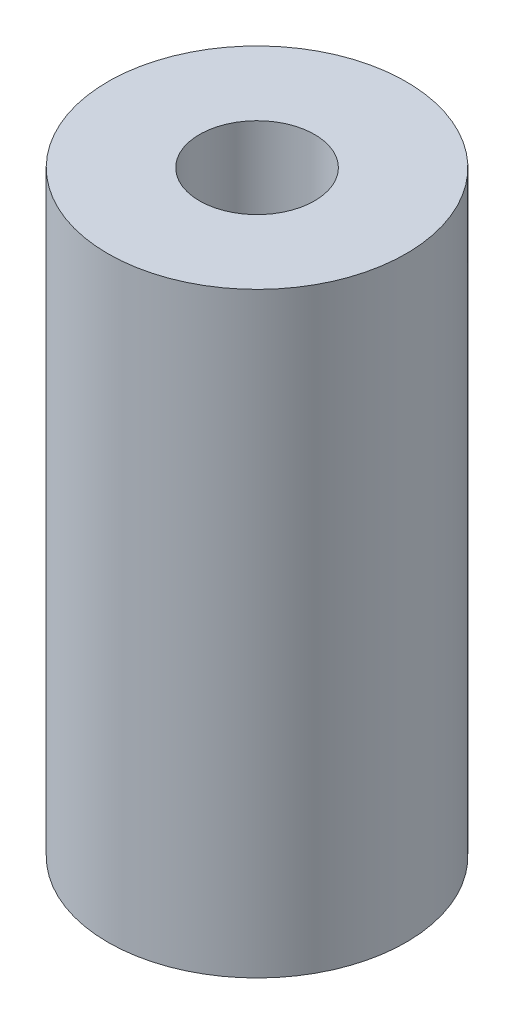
ISO-10303-21;
HEADER;
FILE_DESCRIPTION(('STEP AP214'),'2;1');
FILE_NAME('part.step','',(''),(''),'','','');
FILE_SCHEMA(('AUTOMOTIVE_DESIGN { 1 0 10303 214 1 1 1 1 }'));
ENDSEC;
DATA;
#1=APPLICATION_CONTEXT('core data for automotive mechanical design processes');
#2=APPLICATION_PROTOCOL_DEFINITION('international standard','automotive_design',2000,#1);
#3=PRODUCT_CONTEXT('',#1,'mechanical');
#4=PRODUCT('Part','Part','',(#3));
#5=PRODUCT_RELATED_PRODUCT_CATEGORY('part','',(#4));
#6=PRODUCT_DEFINITION_FORMATION('','',#4);
#7=PRODUCT_DEFINITION_CONTEXT('part definition',#1,'design');
#8=PRODUCT_DEFINITION('design','',#6,#7);
#9=PRODUCT_DEFINITION_SHAPE('','',#8);
#10=(LENGTH_UNIT() NAMED_UNIT(*) SI_UNIT(.MILLI.,.METRE.));
#11=(NAMED_UNIT(*) PLANE_ANGLE_UNIT() SI_UNIT($,.RADIAN.));
#12=(NAMED_UNIT(*) SI_UNIT($,.STERADIAN.) SOLID_ANGLE_UNIT());
#13=UNCERTAINTY_MEASURE_WITH_UNIT(LENGTH_MEASURE(1.E-05),#10,'distance_accuracy_value','');
#14=(GEOMETRIC_REPRESENTATION_CONTEXT(3) GLOBAL_UNCERTAINTY_ASSIGNED_CONTEXT((#13)) GLOBAL_UNIT_ASSIGNED_CONTEXT((#10,
#11,#12)) REPRESENTATION_CONTEXT('',''));
#15=CARTESIAN_POINT('',(0.,0.,0.));
#16=DIRECTION('',(0.,0.,1.));
#17=DIRECTION('',(1.,0.,0.));
#18=AXIS2_PLACEMENT_3D('',#15,#16,#17);
#19=CARTESIAN_POINT('',(0.,50.8,0.));
#20=DIRECTION('',(0.,-1.,0.));
#21=DIRECTION('',(0.,0.,-1.));
#22=AXIS2_PLACEMENT_3D('',#19,#20,#21);
#23=CYLINDRICAL_SURFACE('',#22,12.7);
#24=CARTESIAN_POINT('',(0.,50.8,0.));
#25=DIRECTION('',(0.,1.,0.));
#26=DIRECTION('',(0.,0.,1.));
#27=AXIS2_PLACEMENT_3D('',#24,#25,#26);
#28=CIRCLE('',#27,12.7);
#29=CARTESIAN_POINT('',(0.,50.8,12.7));
#30=VERTEX_POINT('',#29);
#31=EDGE_CURVE('E10',#30,#30,#28,.T.);
#32=ORIENTED_EDGE('',*,*,#31,.F.);
#33=EDGE_LOOP('',(#32));
#34=FACE_BOUND('',#33,.T.);
#35=CARTESIAN_POINT('',(0.,0.,0.));
#36=DIRECTION('',(0.,1.,0.));
#37=DIRECTION('',(0.,0.,1.));
#38=AXIS2_PLACEMENT_3D('',#35,#36,#37);
#39=CIRCLE('',#38,12.7);
#40=CARTESIAN_POINT('',(0.,0.,12.7));
#41=VERTEX_POINT('',#40);
#42=EDGE_CURVE('E34',#41,#41,#39,.T.);
#43=ORIENTED_EDGE('',*,*,#42,.T.);
#44=EDGE_LOOP('',(#43));
#45=FACE_BOUND('',#44,.T.);
#46=ADVANCED_FACE('F31',(#34,#45),#23,.T.);
#47=CARTESIAN_POINT('',(0.,50.8,0.));
#48=DIRECTION('',(0.,1.,0.));
#49=DIRECTION('',(0.,0.,1.));
#50=AXIS2_PLACEMENT_3D('',#47,#48,#49);
#51=PLANE('',#50);
#52=CARTESIAN_POINT('',(0.,50.8,0.));
#53=DIRECTION('',(0.,1.,0.));
#54=DIRECTION('',(0.,0.,1.));
#55=AXIS2_PLACEMENT_3D('',#52,#53,#54);
#56=CIRCLE('',#55,4.90219999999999);
#57=CARTESIAN_POINT('',(0.,50.8,4.90219999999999));
#58=VERTEX_POINT('',#57);
#59=EDGE_CURVE('E45',#58,#58,#56,.T.);
#60=ORIENTED_EDGE('',*,*,#59,.F.);
#61=EDGE_LOOP('',(#60));
#62=FACE_BOUND('',#61,.T.);
#63=ORIENTED_EDGE('',*,*,#31,.T.);
#64=EDGE_LOOP('',(#63));
#65=FACE_BOUND('',#64,.T.);
#66=ADVANCED_FACE('F51',(#62,#65),#51,.T.);
#67=CARTESIAN_POINT('',(0.,0.,0.));
#68=DIRECTION('',(0.,1.,0.));
#69=DIRECTION('',(0.,0.,1.));
#70=AXIS2_PLACEMENT_3D('',#67,#68,#69);
#71=PLANE('',#70);
#72=CARTESIAN_POINT('',(0.,0.,0.));
#73=DIRECTION('',(0.,1.,0.));
#74=DIRECTION('',(0.,0.,1.));
#75=AXIS2_PLACEMENT_3D('',#72,#73,#74);
#76=CIRCLE('',#75,4.90219999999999);
#77=CARTESIAN_POINT('',(0.,0.,4.90219999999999));
#78=VERTEX_POINT('',#77);
#79=EDGE_CURVE('E41',#78,#78,#76,.T.);
#80=ORIENTED_EDGE('',*,*,#79,.T.);
#81=EDGE_LOOP('',(#80));
#82=FACE_BOUND('',#81,.T.);
#83=ORIENTED_EDGE('',*,*,#42,.F.);
#84=EDGE_LOOP('',(#83));
#85=FACE_BOUND('',#84,.T.);
#86=ADVANCED_FACE('F53',(#82,#85),#71,.F.);
#87=CARTESIAN_POINT('',(0.,50.8,0.));
#88=DIRECTION('',(0.,1.,0.));
#89=DIRECTION('',(0.,0.,1.));
#90=AXIS2_PLACEMENT_3D('',#87,#88,#89);
#91=CYLINDRICAL_SURFACE('',#90,4.90219999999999);
#92=ORIENTED_EDGE('',*,*,#79,.F.);
#93=EDGE_LOOP('',(#92));
#94=FACE_BOUND('',#93,.T.);
#95=ORIENTED_EDGE('',*,*,#59,.T.);
#96=EDGE_LOOP('',(#95));
#97=FACE_BOUND('',#96,.T.);
#98=ADVANCED_FACE('F49',(#94,#97),#91,.F.);
#99=CLOSED_SHELL('',(#46,#66,#86,#98));
#100=MANIFOLD_SOLID_BREP('B2',#99);
#101=ADVANCED_BREP_SHAPE_REPRESENTATION('',(#18,#100),#14);
#102=SHAPE_DEFINITION_REPRESENTATION(#9,#101);
ENDSEC;
END-ISO-10303-21;
